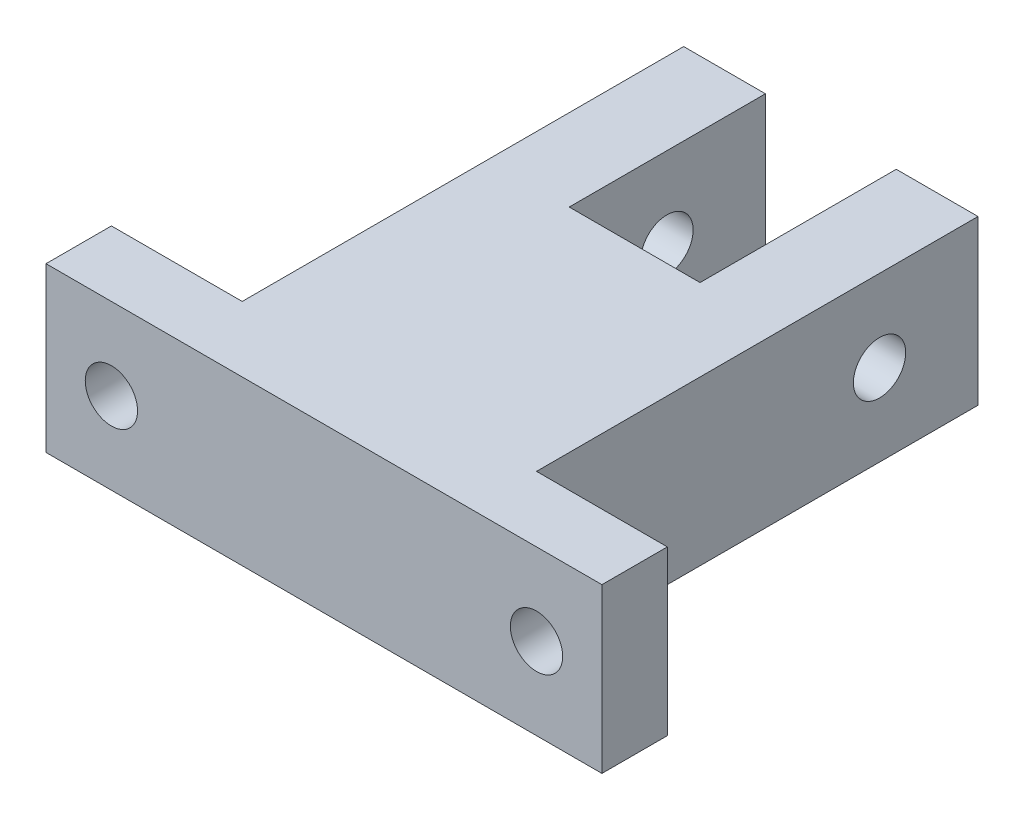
ISO-10303-21;
HEADER;
FILE_DESCRIPTION(('STEP AP214'),'2;1');
FILE_NAME('part.step','',(''),(''),'','','');
FILE_SCHEMA(('AUTOMOTIVE_DESIGN { 1 0 10303 214 1 1 1 1 }'));
ENDSEC;
DATA;
#1=APPLICATION_CONTEXT('core data for automotive mechanical design processes');
#2=APPLICATION_PROTOCOL_DEFINITION('international standard','automotive_design',2000,#1);
#3=PRODUCT_CONTEXT('',#1,'mechanical');
#4=PRODUCT('Part','Part','',(#3));
#5=PRODUCT_RELATED_PRODUCT_CATEGORY('part','',(#4));
#6=PRODUCT_DEFINITION_FORMATION('','',#4);
#7=PRODUCT_DEFINITION_CONTEXT('part definition',#1,'design');
#8=PRODUCT_DEFINITION('design','',#6,#7);
#9=PRODUCT_DEFINITION_SHAPE('','',#8);
#10=(LENGTH_UNIT() NAMED_UNIT(*) SI_UNIT(.MILLI.,.METRE.));
#11=(NAMED_UNIT(*) PLANE_ANGLE_UNIT() SI_UNIT($,.RADIAN.));
#12=(NAMED_UNIT(*) SI_UNIT($,.STERADIAN.) SOLID_ANGLE_UNIT());
#13=UNCERTAINTY_MEASURE_WITH_UNIT(LENGTH_MEASURE(1.E-05),#10,'distance_accuracy_value','');
#14=(GEOMETRIC_REPRESENTATION_CONTEXT(3) GLOBAL_UNCERTAINTY_ASSIGNED_CONTEXT((#13)) GLOBAL_UNIT_ASSIGNED_CONTEXT((#10,
#11,#12)) REPRESENTATION_CONTEXT('',''));
#15=CARTESIAN_POINT('',(0.,0.,0.));
#16=DIRECTION('',(0.,0.,1.));
#17=DIRECTION('',(1.,0.,0.));
#18=AXIS2_PLACEMENT_3D('',#15,#16,#17);
#19=CARTESIAN_POINT('',(9.,10.,-4.));
#20=DIRECTION('',(-1.,0.,0.));
#21=DIRECTION('',(0.,0.,1.));
#22=AXIS2_PLACEMENT_3D('',#19,#20,#21);
#23=PLANE('',#22);
#24=CARTESIAN_POINT('',(9.,5.,-24.978148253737));
#25=DIRECTION('',(1.,0.,0.));
#26=DIRECTION('',(0.,0.,-1.));
#27=AXIS2_PLACEMENT_3D('',#24,#25,#26);
#28=CIRCLE('',#27,1.59999999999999);
#29=CARTESIAN_POINT('',(9.,5.,-26.578148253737));
#30=VERTEX_POINT('',#29);
#31=EDGE_CURVE('E267',#30,#30,#28,.T.);
#32=ORIENTED_EDGE('',*,*,#31,.F.);
#33=EDGE_LOOP('',(#32));
#34=FACE_BOUND('',#33,.T.);
#35=DIRECTION('',(0.,0.,-1.));
#36=VECTOR('',#35,1.);
#37=CARTESIAN_POINT('',(9.,0.,-4.));
#38=LINE('',#37,#36);
#39=CARTESIAN_POINT('',(9.,0.,-4.));
#40=VERTEX_POINT('',#39);
#41=CARTESIAN_POINT('',(8.99999999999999,0.,-31.));
#42=VERTEX_POINT('',#41);
#43=EDGE_CURVE('E155',#40,#42,#38,.T.);
#44=ORIENTED_EDGE('',*,*,#43,.T.);
#45=DIRECTION('',(0.,-1.,0.));
#46=VECTOR('',#45,1.);
#47=CARTESIAN_POINT('',(8.99999999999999,10.,-31.));
#48=LINE('',#47,#46);
#49=CARTESIAN_POINT('',(8.99999999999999,10.,-31.));
#50=VERTEX_POINT('',#49);
#51=EDGE_CURVE('E11',#50,#42,#48,.T.);
#52=ORIENTED_EDGE('',*,*,#51,.F.);
#53=DIRECTION('',(0.,0.,-1.));
#54=VECTOR('',#53,1.);
#55=CARTESIAN_POINT('',(9.,10.,-4.));
#56=LINE('',#55,#54);
#57=CARTESIAN_POINT('',(9.,10.,-4.));
#58=VERTEX_POINT('',#57);
#59=EDGE_CURVE('E178',#58,#50,#56,.T.);
#60=ORIENTED_EDGE('',*,*,#59,.F.);
#61=DIRECTION('',(0.,-1.,0.));
#62=VECTOR('',#61,1.);
#63=CARTESIAN_POINT('',(9.,10.,-4.));
#64=LINE('',#63,#62);
#65=EDGE_CURVE('E151',#58,#40,#64,.T.);
#66=ORIENTED_EDGE('',*,*,#65,.T.);
#67=EDGE_LOOP('',(#44,#52,#60,#66));
#68=FACE_BOUND('',#67,.T.);
#69=ADVANCED_FACE('F33',(#34,#68),#23,.F.);
#70=CARTESIAN_POINT('',(8.99999999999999,10.,-31.));
#71=DIRECTION('',(0.,0.,1.));
#72=DIRECTION('',(1.,0.,0.));
#73=AXIS2_PLACEMENT_3D('',#70,#71,#72);
#74=PLANE('',#73);
#75=DIRECTION('',(-1.,0.,0.));
#76=VECTOR('',#75,1.);
#77=CARTESIAN_POINT('',(8.99999999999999,0.,-31.));
#78=LINE('',#77,#76);
#79=CARTESIAN_POINT('',(3.99999999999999,0.,-31.));
#80=VERTEX_POINT('',#79);
#81=EDGE_CURVE('E158',#42,#80,#78,.T.);
#82=ORIENTED_EDGE('',*,*,#81,.T.);
#83=DIRECTION('',(0.,-1.,0.));
#84=VECTOR('',#83,1.);
#85=CARTESIAN_POINT('',(3.99999999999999,10.,-31.));
#86=LINE('',#85,#84);
#87=CARTESIAN_POINT('',(3.99999999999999,10.,-31.));
#88=VERTEX_POINT('',#87);
#89=EDGE_CURVE('E42',#88,#80,#86,.T.);
#90=ORIENTED_EDGE('',*,*,#89,.F.);
#91=DIRECTION('',(-1.,0.,0.));
#92=VECTOR('',#91,1.);
#93=CARTESIAN_POINT('',(8.99999999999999,10.,-31.));
#94=LINE('',#93,#92);
#95=EDGE_CURVE('E106',#50,#88,#94,.T.);
#96=ORIENTED_EDGE('',*,*,#95,.F.);
#97=ORIENTED_EDGE('',*,*,#51,.T.);
#98=EDGE_LOOP('',(#82,#90,#96,#97));
#99=FACE_BOUND('',#98,.T.);
#100=ADVANCED_FACE('F259',(#99),#74,.F.);
#101=CARTESIAN_POINT('',(3.99999999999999,10.,-31.));
#102=DIRECTION('',(1.,0.,0.));
#103=DIRECTION('',(0.,0.,-1.));
#104=AXIS2_PLACEMENT_3D('',#101,#102,#103);
#105=PLANE('',#104);
#106=CARTESIAN_POINT('',(4.,5.,-24.978148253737));
#107=DIRECTION('',(1.,0.,0.));
#108=DIRECTION('',(0.,0.,-1.));
#109=AXIS2_PLACEMENT_3D('',#106,#107,#108);
#110=CIRCLE('',#109,1.59999999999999);
#111=CARTESIAN_POINT('',(4.,5.,-26.578148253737));
#112=VERTEX_POINT('',#111);
#113=EDGE_CURVE('E213',#112,#112,#110,.F.);
#114=ORIENTED_EDGE('',*,*,#113,.F.);
#115=EDGE_LOOP('',(#114));
#116=FACE_BOUND('',#115,.T.);
#117=DIRECTION('',(0.,0.,1.));
#118=VECTOR('',#117,1.);
#119=CARTESIAN_POINT('',(3.99999999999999,0.,-31.));
#120=LINE('',#119,#118);
#121=CARTESIAN_POINT('',(4.,0.,-19.));
#122=VERTEX_POINT('',#121);
#123=EDGE_CURVE('E161',#80,#122,#120,.T.);
#124=ORIENTED_EDGE('',*,*,#123,.T.);
#125=DIRECTION('',(0.,-1.,0.));
#126=VECTOR('',#125,1.);
#127=CARTESIAN_POINT('',(4.,10.,-19.));
#128=LINE('',#127,#126);
#129=CARTESIAN_POINT('',(4.,10.,-19.));
#130=VERTEX_POINT('',#129);
#131=EDGE_CURVE('E197',#130,#122,#128,.T.);
#132=ORIENTED_EDGE('',*,*,#131,.F.);
#133=DIRECTION('',(0.,0.,1.));
#134=VECTOR('',#133,1.);
#135=CARTESIAN_POINT('',(3.99999999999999,10.,-31.));
#136=LINE('',#135,#134);
#137=EDGE_CURVE('E219',#88,#130,#136,.T.);
#138=ORIENTED_EDGE('',*,*,#137,.F.);
#139=ORIENTED_EDGE('',*,*,#89,.T.);
#140=EDGE_LOOP('',(#124,#132,#138,#139));
#141=FACE_BOUND('',#140,.T.);
#142=ADVANCED_FACE('F264',(#116,#141),#105,.F.);
#143=CARTESIAN_POINT('',(4.,10.,-19.));
#144=DIRECTION('',(0.,0.,1.));
#145=DIRECTION('',(1.,0.,0.));
#146=AXIS2_PLACEMENT_3D('',#143,#144,#145);
#147=PLANE('',#146);
#148=DIRECTION('',(-1.,0.,0.));
#149=VECTOR('',#148,1.);
#150=CARTESIAN_POINT('',(4.,0.,-19.));
#151=LINE('',#150,#149);
#152=CARTESIAN_POINT('',(-4.,0.,-19.));
#153=VERTEX_POINT('',#152);
#154=EDGE_CURVE('E163',#122,#153,#151,.T.);
#155=ORIENTED_EDGE('',*,*,#154,.T.);
#156=DIRECTION('',(0.,-1.,0.));
#157=VECTOR('',#156,1.);
#158=CARTESIAN_POINT('',(-4.,10.,-19.));
#159=LINE('',#158,#157);
#160=CARTESIAN_POINT('',(-4.,10.,-19.));
#161=VERTEX_POINT('',#160);
#162=EDGE_CURVE('E194',#161,#153,#159,.T.);
#163=ORIENTED_EDGE('',*,*,#162,.F.);
#164=DIRECTION('',(-1.,0.,0.));
#165=VECTOR('',#164,1.);
#166=CARTESIAN_POINT('',(4.,10.,-19.));
#167=LINE('',#166,#165);
#168=EDGE_CURVE('E221',#130,#161,#167,.T.);
#169=ORIENTED_EDGE('',*,*,#168,.F.);
#170=ORIENTED_EDGE('',*,*,#131,.T.);
#171=EDGE_LOOP('',(#155,#163,#169,#170));
#172=FACE_BOUND('',#171,.T.);
#173=ADVANCED_FACE('F292',(#172),#147,.F.);
#174=CARTESIAN_POINT('',(-4.,10.,-19.));
#175=DIRECTION('',(-1.,0.,0.));
#176=DIRECTION('',(0.,0.,1.));
#177=AXIS2_PLACEMENT_3D('',#174,#175,#176);
#178=PLANE('',#177);
#179=CARTESIAN_POINT('',(-4.,5.,-24.978148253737));
#180=DIRECTION('',(-1.,0.,0.));
#181=DIRECTION('',(0.,0.,1.));
#182=AXIS2_PLACEMENT_3D('',#179,#180,#181);
#183=CIRCLE('',#182,1.59999999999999);
#184=CARTESIAN_POINT('',(-4.,5.,-23.378148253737));
#185=VERTEX_POINT('',#184);
#186=EDGE_CURVE('E269',#185,#185,#183,.F.);
#187=ORIENTED_EDGE('',*,*,#186,.F.);
#188=EDGE_LOOP('',(#187));
#189=FACE_BOUND('',#188,.T.);
#190=DIRECTION('',(0.,0.,-1.));
#191=VECTOR('',#190,1.);
#192=CARTESIAN_POINT('',(-4.,0.,-19.));
#193=LINE('',#192,#191);
#194=CARTESIAN_POINT('',(-4.,0.,-31.));
#195=VERTEX_POINT('',#194);
#196=EDGE_CURVE('E165',#153,#195,#193,.T.);
#197=ORIENTED_EDGE('',*,*,#196,.T.);
#198=DIRECTION('',(0.,-1.,0.));
#199=VECTOR('',#198,1.);
#200=CARTESIAN_POINT('',(-4.,10.,-31.));
#201=LINE('',#200,#199);
#202=CARTESIAN_POINT('',(-4.,10.,-31.));
#203=VERTEX_POINT('',#202);
#204=EDGE_CURVE('E191',#203,#195,#201,.T.);
#205=ORIENTED_EDGE('',*,*,#204,.F.);
#206=DIRECTION('',(0.,0.,-1.));
#207=VECTOR('',#206,1.);
#208=CARTESIAN_POINT('',(-4.,10.,-19.));
#209=LINE('',#208,#207);
#210=EDGE_CURVE('E223',#161,#203,#209,.T.);
#211=ORIENTED_EDGE('',*,*,#210,.F.);
#212=ORIENTED_EDGE('',*,*,#162,.T.);
#213=EDGE_LOOP('',(#197,#205,#211,#212));
#214=FACE_BOUND('',#213,.T.);
#215=ADVANCED_FACE('F288',(#189,#214),#178,.F.);
#216=CARTESIAN_POINT('',(-4.,10.,-31.));
#217=DIRECTION('',(0.,0.,1.));
#218=DIRECTION('',(1.,0.,0.));
#219=AXIS2_PLACEMENT_3D('',#216,#217,#218);
#220=PLANE('',#219);
#221=DIRECTION('',(-1.,0.,0.));
#222=VECTOR('',#221,1.);
#223=CARTESIAN_POINT('',(-4.,0.,-31.));
#224=LINE('',#223,#222);
#225=CARTESIAN_POINT('',(-9.,0.,-31.));
#226=VERTEX_POINT('',#225);
#227=EDGE_CURVE('E167',#195,#226,#224,.T.);
#228=ORIENTED_EDGE('',*,*,#227,.T.);
#229=DIRECTION('',(0.,-1.,0.));
#230=VECTOR('',#229,1.);
#231=CARTESIAN_POINT('',(-9.,10.,-31.));
#232=LINE('',#231,#230);
#233=CARTESIAN_POINT('',(-9.,10.,-31.));
#234=VERTEX_POINT('',#233);
#235=EDGE_CURVE('E188',#234,#226,#232,.T.);
#236=ORIENTED_EDGE('',*,*,#235,.F.);
#237=DIRECTION('',(-1.,0.,0.));
#238=VECTOR('',#237,1.);
#239=CARTESIAN_POINT('',(-4.,10.,-31.));
#240=LINE('',#239,#238);
#241=EDGE_CURVE('E225',#203,#234,#240,.T.);
#242=ORIENTED_EDGE('',*,*,#241,.F.);
#243=ORIENTED_EDGE('',*,*,#204,.T.);
#244=EDGE_LOOP('',(#228,#236,#242,#243));
#245=FACE_BOUND('',#244,.T.);
#246=ADVANCED_FACE('F291',(#245),#220,.F.);
#247=CARTESIAN_POINT('',(-9.,10.,-31.));
#248=DIRECTION('',(1.,0.,0.));
#249=DIRECTION('',(0.,0.,-1.));
#250=AXIS2_PLACEMENT_3D('',#247,#248,#249);
#251=PLANE('',#250);
#252=CARTESIAN_POINT('',(-9.,5.,-24.978148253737));
#253=DIRECTION('',(1.,0.,0.));
#254=DIRECTION('',(0.,0.,-1.));
#255=AXIS2_PLACEMENT_3D('',#252,#253,#254);
#256=CIRCLE('',#255,1.59999999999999);
#257=CARTESIAN_POINT('',(-9.,5.,-26.578148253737));
#258=VERTEX_POINT('',#257);
#259=EDGE_CURVE('E270',#258,#258,#256,.T.);
#260=ORIENTED_EDGE('',*,*,#259,.T.);
#261=EDGE_LOOP('',(#260));
#262=FACE_BOUND('',#261,.T.);
#263=DIRECTION('',(0.,0.,1.));
#264=VECTOR('',#263,1.);
#265=CARTESIAN_POINT('',(-9.,0.,-31.));
#266=LINE('',#265,#264);
#267=CARTESIAN_POINT('',(-9.,0.,-4.));
#268=VERTEX_POINT('',#267);
#269=EDGE_CURVE('E169',#226,#268,#266,.T.);
#270=ORIENTED_EDGE('',*,*,#269,.T.);
#271=DIRECTION('',(0.,-1.,0.));
#272=VECTOR('',#271,1.);
#273=CARTESIAN_POINT('',(-9.,10.,-4.));
#274=LINE('',#273,#272);
#275=CARTESIAN_POINT('',(-9.,10.,-4.));
#276=VERTEX_POINT('',#275);
#277=EDGE_CURVE('E185',#276,#268,#274,.T.);
#278=ORIENTED_EDGE('',*,*,#277,.F.);
#279=DIRECTION('',(0.,0.,1.));
#280=VECTOR('',#279,1.);
#281=CARTESIAN_POINT('',(-9.,10.,-31.));
#282=LINE('',#281,#280);
#283=EDGE_CURVE('E227',#234,#276,#282,.T.);
#284=ORIENTED_EDGE('',*,*,#283,.F.);
#285=ORIENTED_EDGE('',*,*,#235,.T.);
#286=EDGE_LOOP('',(#270,#278,#284,#285));
#287=FACE_BOUND('',#286,.T.);
#288=ADVANCED_FACE('F277',(#262,#287),#251,.F.);
#289=CARTESIAN_POINT('',(-9.,10.,-4.));
#290=DIRECTION('',(0.,0.,1.));
#291=DIRECTION('',(1.,0.,0.));
#292=AXIS2_PLACEMENT_3D('',#289,#290,#291);
#293=PLANE('',#292);
#294=CARTESIAN_POINT('',(-13.,4.99999999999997,-4.));
#295=DIRECTION('',(0.,0.,1.));
#296=DIRECTION('',(1.,0.,0.));
#297=AXIS2_PLACEMENT_3D('',#294,#295,#296);
#298=CIRCLE('',#297,1.6);
#299=CARTESIAN_POINT('',(-11.4,4.99999999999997,-4.));
#300=VERTEX_POINT('',#299);
#301=EDGE_CURVE('E159',#300,#300,#298,.T.);
#302=ORIENTED_EDGE('',*,*,#301,.T.);
#303=EDGE_LOOP('',(#302));
#304=FACE_BOUND('',#303,.T.);
#305=DIRECTION('',(-1.,0.,0.));
#306=VECTOR('',#305,1.);
#307=CARTESIAN_POINT('',(-9.,0.,-4.));
#308=LINE('',#307,#306);
#309=CARTESIAN_POINT('',(-17.,0.,-4.));
#310=VERTEX_POINT('',#309);
#311=EDGE_CURVE('E171',#268,#310,#308,.T.);
#312=ORIENTED_EDGE('',*,*,#311,.T.);
#313=DIRECTION('',(0.,-1.,0.));
#314=VECTOR('',#313,1.);
#315=CARTESIAN_POINT('',(-17.,10.,-4.));
#316=LINE('',#315,#314);
#317=CARTESIAN_POINT('',(-17.,10.,-4.));
#318=VERTEX_POINT('',#317);
#319=EDGE_CURVE('E182',#318,#310,#316,.T.);
#320=ORIENTED_EDGE('',*,*,#319,.F.);
#321=DIRECTION('',(-1.,0.,0.));
#322=VECTOR('',#321,1.);
#323=CARTESIAN_POINT('',(-9.,10.,-4.));
#324=LINE('',#323,#322);
#325=EDGE_CURVE('E229',#276,#318,#324,.T.);
#326=ORIENTED_EDGE('',*,*,#325,.F.);
#327=ORIENTED_EDGE('',*,*,#277,.T.);
#328=EDGE_LOOP('',(#312,#320,#326,#327));
#329=FACE_BOUND('',#328,.T.);
#330=ADVANCED_FACE('F235',(#304,#329),#293,.F.);
#331=CARTESIAN_POINT('',(-17.,10.,-4.));
#332=DIRECTION('',(1.,0.,0.));
#333=DIRECTION('',(0.,0.,-1.));
#334=AXIS2_PLACEMENT_3D('',#331,#332,#333);
#335=PLANE('',#334);
#336=DIRECTION('',(0.,0.,1.));
#337=VECTOR('',#336,1.);
#338=CARTESIAN_POINT('',(-17.,0.,-4.));
#339=LINE('',#338,#337);
#340=CARTESIAN_POINT('',(-17.,0.,0.));
#341=VERTEX_POINT('',#340);
#342=EDGE_CURVE('E173',#310,#341,#339,.T.);
#343=ORIENTED_EDGE('',*,*,#342,.T.);
#344=DIRECTION('',(0.,-1.,0.));
#345=VECTOR('',#344,1.);
#346=CARTESIAN_POINT('',(-17.,10.,0.));
#347=LINE('',#346,#345);
#348=CARTESIAN_POINT('',(-17.,10.,0.));
#349=VERTEX_POINT('',#348);
#350=EDGE_CURVE('E146',#349,#341,#347,.T.);
#351=ORIENTED_EDGE('',*,*,#350,.F.);
#352=DIRECTION('',(0.,0.,1.));
#353=VECTOR('',#352,1.);
#354=CARTESIAN_POINT('',(-17.,10.,-4.));
#355=LINE('',#354,#353);
#356=EDGE_CURVE('E137',#318,#349,#355,.T.);
#357=ORIENTED_EDGE('',*,*,#356,.F.);
#358=ORIENTED_EDGE('',*,*,#319,.T.);
#359=EDGE_LOOP('',(#343,#351,#357,#358));
#360=FACE_BOUND('',#359,.T.);
#361=ADVANCED_FACE('F239',(#360),#335,.F.);
#362=CARTESIAN_POINT('',(-17.,10.,0.));
#363=DIRECTION('',(0.,0.,-1.));
#364=DIRECTION('',(-1.,0.,0.));
#365=AXIS2_PLACEMENT_3D('',#362,#363,#364);
#366=PLANE('',#365);
#367=CARTESIAN_POINT('',(13.,5.,0.));
#368=DIRECTION('',(0.,0.,-1.));
#369=DIRECTION('',(-1.,0.,0.));
#370=AXIS2_PLACEMENT_3D('',#367,#368,#369);
#371=CIRCLE('',#370,1.6);
#372=CARTESIAN_POINT('',(11.4,5.,0.));
#373=VERTEX_POINT('',#372);
#374=EDGE_CURVE('E203',#373,#373,#371,.T.);
#375=ORIENTED_EDGE('',*,*,#374,.T.);
#376=EDGE_LOOP('',(#375));
#377=FACE_BOUND('',#376,.T.);
#378=CARTESIAN_POINT('',(-13.,4.99999999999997,0.));
#379=DIRECTION('',(0.,0.,-1.));
#380=DIRECTION('',(-1.,0.,0.));
#381=AXIS2_PLACEMENT_3D('',#378,#379,#380);
#382=CIRCLE('',#381,1.6);
#383=CARTESIAN_POINT('',(-14.6,4.99999999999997,0.));
#384=VERTEX_POINT('',#383);
#385=EDGE_CURVE('E201',#384,#384,#382,.T.);
#386=ORIENTED_EDGE('',*,*,#385,.T.);
#387=EDGE_LOOP('',(#386));
#388=FACE_BOUND('',#387,.T.);
#389=DIRECTION('',(1.,0.,0.));
#390=VECTOR('',#389,1.);
#391=CARTESIAN_POINT('',(-17.,0.,0.));
#392=LINE('',#391,#390);
#393=CARTESIAN_POINT('',(17.,0.,0.));
#394=VERTEX_POINT('',#393);
#395=EDGE_CURVE('E145',#341,#394,#392,.T.);
#396=ORIENTED_EDGE('',*,*,#395,.T.);
#397=DIRECTION('',(0.,-1.,0.));
#398=VECTOR('',#397,1.);
#399=CARTESIAN_POINT('',(17.,10.,0.));
#400=LINE('',#399,#398);
#401=CARTESIAN_POINT('',(17.,10.,0.));
#402=VERTEX_POINT('',#401);
#403=EDGE_CURVE('E142',#402,#394,#400,.T.);
#404=ORIENTED_EDGE('',*,*,#403,.F.);
#405=DIRECTION('',(1.,0.,0.));
#406=VECTOR('',#405,1.);
#407=CARTESIAN_POINT('',(-17.,10.,0.));
#408=LINE('',#407,#406);
#409=EDGE_CURVE('E131',#349,#402,#408,.T.);
#410=ORIENTED_EDGE('',*,*,#409,.F.);
#411=ORIENTED_EDGE('',*,*,#350,.T.);
#412=EDGE_LOOP('',(#396,#404,#410,#411));
#413=FACE_BOUND('',#412,.T.);
#414=ADVANCED_FACE('F143',(#377,#388,#413),#366,.F.);
#415=CARTESIAN_POINT('',(17.,10.,0.));
#416=DIRECTION('',(-1.,0.,0.));
#417=DIRECTION('',(0.,0.,1.));
#418=AXIS2_PLACEMENT_3D('',#415,#416,#417);
#419=PLANE('',#418);
#420=DIRECTION('',(0.,0.,-1.));
#421=VECTOR('',#420,1.);
#422=CARTESIAN_POINT('',(17.,0.,0.));
#423=LINE('',#422,#421);
#424=CARTESIAN_POINT('',(17.,0.,-4.));
#425=VERTEX_POINT('',#424);
#426=EDGE_CURVE('E92',#394,#425,#423,.T.);
#427=ORIENTED_EDGE('',*,*,#426,.T.);
#428=DIRECTION('',(0.,-1.,0.));
#429=VECTOR('',#428,1.);
#430=CARTESIAN_POINT('',(17.,10.,-4.));
#431=LINE('',#430,#429);
#432=CARTESIAN_POINT('',(17.,10.,-4.));
#433=VERTEX_POINT('',#432);
#434=EDGE_CURVE('E147',#433,#425,#431,.T.);
#435=ORIENTED_EDGE('',*,*,#434,.F.);
#436=DIRECTION('',(0.,0.,-1.));
#437=VECTOR('',#436,1.);
#438=CARTESIAN_POINT('',(17.,10.,0.));
#439=LINE('',#438,#437);
#440=EDGE_CURVE('E135',#402,#433,#439,.T.);
#441=ORIENTED_EDGE('',*,*,#440,.F.);
#442=ORIENTED_EDGE('',*,*,#403,.T.);
#443=EDGE_LOOP('',(#427,#435,#441,#442));
#444=FACE_BOUND('',#443,.T.);
#445=ADVANCED_FACE('F149',(#444),#419,.F.);
#446=CARTESIAN_POINT('',(17.,10.,-4.));
#447=DIRECTION('',(0.,0.,1.));
#448=DIRECTION('',(1.,0.,0.));
#449=AXIS2_PLACEMENT_3D('',#446,#447,#448);
#450=PLANE('',#449);
#451=CARTESIAN_POINT('',(13.,5.,-4.));
#452=DIRECTION('',(0.,0.,1.));
#453=DIRECTION('',(1.,0.,0.));
#454=AXIS2_PLACEMENT_3D('',#451,#452,#453);
#455=CIRCLE('',#454,1.6);
#456=CARTESIAN_POINT('',(14.6,5.,-4.));
#457=VERTEX_POINT('',#456);
#458=EDGE_CURVE('E36',#457,#457,#455,.T.);
#459=ORIENTED_EDGE('',*,*,#458,.T.);
#460=EDGE_LOOP('',(#459));
#461=FACE_BOUND('',#460,.T.);
#462=DIRECTION('',(-1.,0.,0.));
#463=VECTOR('',#462,1.);
#464=CARTESIAN_POINT('',(17.,0.,-4.));
#465=LINE('',#464,#463);
#466=EDGE_CURVE('E98',#425,#40,#465,.T.);
#467=ORIENTED_EDGE('',*,*,#466,.T.);
#468=ORIENTED_EDGE('',*,*,#65,.F.);
#469=DIRECTION('',(-1.,0.,0.));
#470=VECTOR('',#469,1.);
#471=CARTESIAN_POINT('',(17.,10.,-4.));
#472=LINE('',#471,#470);
#473=EDGE_CURVE('E51',#433,#58,#472,.T.);
#474=ORIENTED_EDGE('',*,*,#473,.F.);
#475=ORIENTED_EDGE('',*,*,#434,.T.);
#476=EDGE_LOOP('',(#467,#468,#474,#475));
#477=FACE_BOUND('',#476,.T.);
#478=ADVANCED_FACE('F247',(#461,#477),#450,.F.);
#479=CARTESIAN_POINT('',(0.,10.,0.));
#480=DIRECTION('',(0.,1.,0.));
#481=DIRECTION('',(0.,0.,1.));
#482=AXIS2_PLACEMENT_3D('',#479,#480,#481);
#483=PLANE('',#482);
#484=ORIENTED_EDGE('',*,*,#59,.T.);
#485=ORIENTED_EDGE('',*,*,#95,.T.);
#486=ORIENTED_EDGE('',*,*,#137,.T.);
#487=ORIENTED_EDGE('',*,*,#168,.T.);
#488=ORIENTED_EDGE('',*,*,#210,.T.);
#489=ORIENTED_EDGE('',*,*,#241,.T.);
#490=ORIENTED_EDGE('',*,*,#283,.T.);
#491=ORIENTED_EDGE('',*,*,#325,.T.);
#492=ORIENTED_EDGE('',*,*,#356,.T.);
#493=ORIENTED_EDGE('',*,*,#409,.T.);
#494=ORIENTED_EDGE('',*,*,#440,.T.);
#495=ORIENTED_EDGE('',*,*,#473,.T.);
#496=EDGE_LOOP('',(#484,#485,#486,#487,#488,#489,#490,#491,#492,#493,#494,#495));
#497=FACE_BOUND('',#496,.T.);
#498=ADVANCED_FACE('F133',(#497),#483,.T.);
#499=CARTESIAN_POINT('',(0.,0.,0.));
#500=DIRECTION('',(0.,1.,0.));
#501=DIRECTION('',(0.,0.,1.));
#502=AXIS2_PLACEMENT_3D('',#499,#500,#501);
#503=PLANE('',#502);
#504=ORIENTED_EDGE('',*,*,#43,.F.);
#505=ORIENTED_EDGE('',*,*,#466,.F.);
#506=ORIENTED_EDGE('',*,*,#426,.F.);
#507=ORIENTED_EDGE('',*,*,#395,.F.);
#508=ORIENTED_EDGE('',*,*,#342,.F.);
#509=ORIENTED_EDGE('',*,*,#311,.F.);
#510=ORIENTED_EDGE('',*,*,#269,.F.);
#511=ORIENTED_EDGE('',*,*,#227,.F.);
#512=ORIENTED_EDGE('',*,*,#196,.F.);
#513=ORIENTED_EDGE('',*,*,#154,.F.);
#514=ORIENTED_EDGE('',*,*,#123,.F.);
#515=ORIENTED_EDGE('',*,*,#81,.F.);
#516=EDGE_LOOP('',(#504,#505,#506,#507,#508,#509,#510,#511,#512,#513,#514,#515));
#517=FACE_BOUND('',#516,.T.);
#518=ADVANCED_FACE('F242',(#517),#503,.F.);
#519=CARTESIAN_POINT('',(-13.,4.99999999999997,-6.));
#520=DIRECTION('',(0.,0.,1.));
#521=DIRECTION('',(1.,0.,0.));
#522=AXIS2_PLACEMENT_3D('',#519,#520,#521);
#523=CYLINDRICAL_SURFACE('',#522,1.6);
#524=ORIENTED_EDGE('',*,*,#385,.F.);
#525=EDGE_LOOP('',(#524));
#526=FACE_BOUND('',#525,.T.);
#527=ORIENTED_EDGE('',*,*,#301,.F.);
#528=EDGE_LOOP('',(#527));
#529=FACE_BOUND('',#528,.T.);
#530=ADVANCED_FACE('F335',(#526,#529),#523,.F.);
#531=CARTESIAN_POINT('',(13.,5.,-6.));
#532=DIRECTION('',(0.,0.,1.));
#533=DIRECTION('',(1.,0.,0.));
#534=AXIS2_PLACEMENT_3D('',#531,#532,#533);
#535=CYLINDRICAL_SURFACE('',#534,1.6);
#536=ORIENTED_EDGE('',*,*,#458,.F.);
#537=EDGE_LOOP('',(#536));
#538=FACE_BOUND('',#537,.T.);
#539=ORIENTED_EDGE('',*,*,#374,.F.);
#540=EDGE_LOOP('',(#539));
#541=FACE_BOUND('',#540,.T.);
#542=ADVANCED_FACE('F284',(#538,#541),#535,.F.);
#543=CARTESIAN_POINT('',(9.,5.,-24.978148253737));
#544=DIRECTION('',(-1.,0.,0.));
#545=DIRECTION('',(0.,0.,1.));
#546=AXIS2_PLACEMENT_3D('',#543,#544,#545);
#547=CYLINDRICAL_SURFACE('',#546,1.59999999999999);
#548=ORIENTED_EDGE('',*,*,#259,.F.);
#549=EDGE_LOOP('',(#548));
#550=FACE_BOUND('',#549,.T.);
#551=ORIENTED_EDGE('',*,*,#186,.T.);
#552=EDGE_LOOP('',(#551));
#553=FACE_BOUND('',#552,.T.);
#554=ADVANCED_FACE('F280',(#550,#553),#547,.F.);
#555=ORIENTED_EDGE('',*,*,#31,.T.);
#556=EDGE_LOOP('',(#555));
#557=FACE_BOUND('',#556,.T.);
#558=ORIENTED_EDGE('',*,*,#113,.T.);
#559=EDGE_LOOP('',(#558));
#560=FACE_BOUND('',#559,.T.);
#561=ADVANCED_FACE('F283',(#557,#560),#547,.F.);
#562=CLOSED_SHELL('',(#69,#100,#142,#173,#215,#246,#288,#330,#361,#414,#445,#478,#498,#518,#530,
#542,#554,#561));
#563=MANIFOLD_SOLID_BREP('B2',#562);
#564=ADVANCED_BREP_SHAPE_REPRESENTATION('',(#18,#563),#14);
#565=SHAPE_DEFINITION_REPRESENTATION(#9,#564);
ENDSEC;
END-ISO-10303-21;
